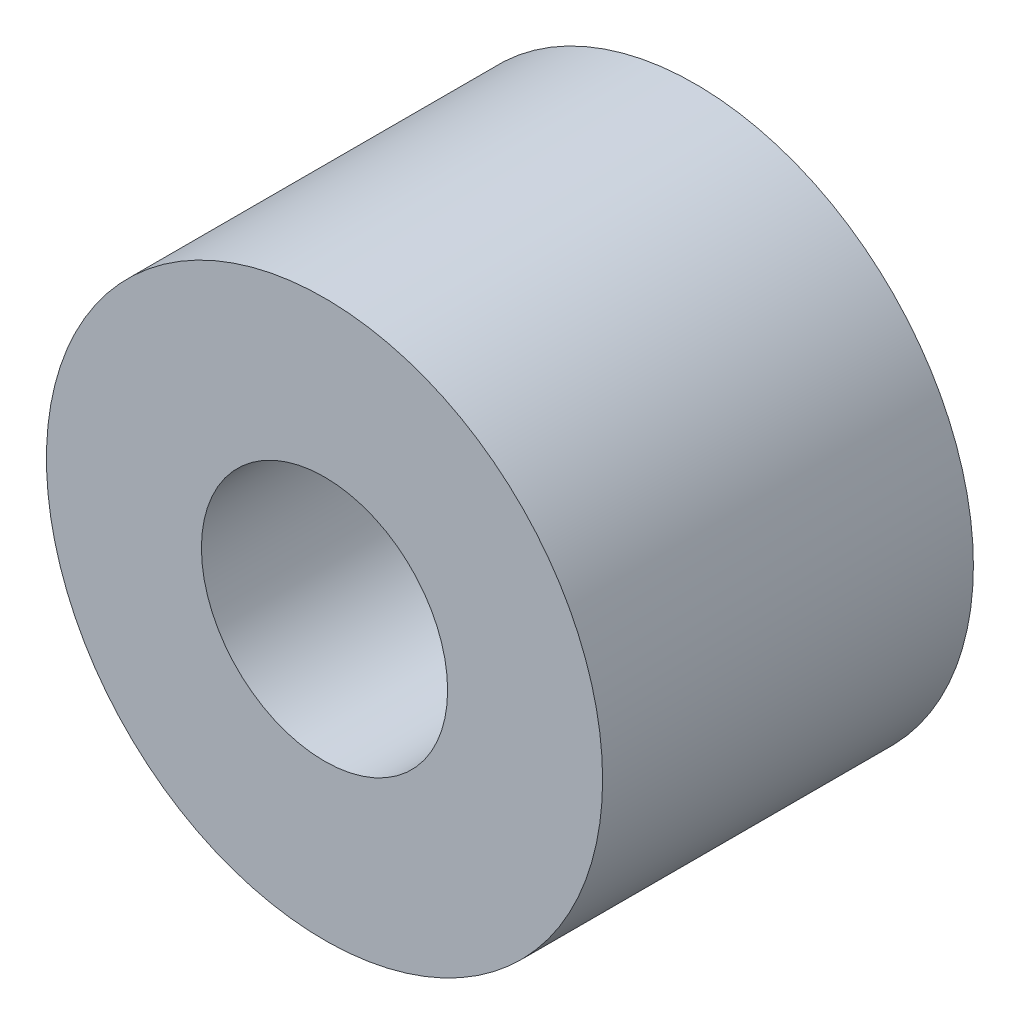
from build123d import *

# Parameters (mm, degrees)
EXTRUDE1_DEPTH      = 3.175
EXTRUDE1_DEPTH_BACK = 3.175
SKETCH1_R           = 4.7625
SKETCH1_R_2         = 2.1082


with BuildPart() as part:
    # Sketch1 → Extrude1 (new, two sides: drawn at the far end of the back side and taken through both)
    with BuildSketch(Plane.XY.offset(-EXTRUDE1_DEPTH_BACK)):
        Circle(SKETCH1_R)
        Circle(SKETCH1_R_2, mode=Mode.SUBTRACT)
    extrude(amount=EXTRUDE1_DEPTH + EXTRUDE1_DEPTH_BACK)


solid = part.part
